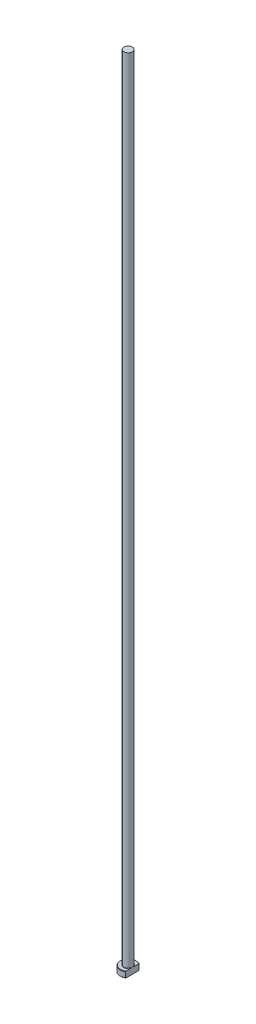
ISO-10303-21;
HEADER;
FILE_DESCRIPTION(('STEP AP214'),'2;1');
FILE_NAME('part.step','',(''),(''),'','','');
FILE_SCHEMA(('AUTOMOTIVE_DESIGN { 1 0 10303 214 1 1 1 1 }'));
ENDSEC;
DATA;
#1=APPLICATION_CONTEXT('core data for automotive mechanical design processes');
#2=APPLICATION_PROTOCOL_DEFINITION('international standard','automotive_design',2000,#1);
#3=PRODUCT_CONTEXT('',#1,'mechanical');
#4=PRODUCT('Part','Part','',(#3));
#5=PRODUCT_RELATED_PRODUCT_CATEGORY('part','',(#4));
#6=PRODUCT_DEFINITION_FORMATION('','',#4);
#7=PRODUCT_DEFINITION_CONTEXT('part definition',#1,'design');
#8=PRODUCT_DEFINITION('design','',#6,#7);
#9=PRODUCT_DEFINITION_SHAPE('','',#8);
#10=(LENGTH_UNIT() NAMED_UNIT(*) SI_UNIT(.MILLI.,.METRE.));
#11=(NAMED_UNIT(*) PLANE_ANGLE_UNIT() SI_UNIT($,.RADIAN.));
#12=(NAMED_UNIT(*) SI_UNIT($,.STERADIAN.) SOLID_ANGLE_UNIT());
#13=UNCERTAINTY_MEASURE_WITH_UNIT(LENGTH_MEASURE(1.E-05),#10,'distance_accuracy_value','');
#14=(GEOMETRIC_REPRESENTATION_CONTEXT(3) GLOBAL_UNCERTAINTY_ASSIGNED_CONTEXT((#13)) GLOBAL_UNIT_ASSIGNED_CONTEXT((#10,
#11,#12)) REPRESENTATION_CONTEXT('',''));
#15=CARTESIAN_POINT('',(0.,0.,0.));
#16=DIRECTION('',(0.,0.,1.));
#17=DIRECTION('',(1.,0.,0.));
#18=AXIS2_PLACEMENT_3D('',#15,#16,#17);
#19=CARTESIAN_POINT('',(0.,0.,0.));
#20=DIRECTION('',(0.,-1.,0.));
#21=DIRECTION('',(0.,0.,-1.));
#22=AXIS2_PLACEMENT_3D('',#19,#20,#21);
#23=PLANE('',#22);
#24=CARTESIAN_POINT('',(0.,0.,0.));
#25=DIRECTION('',(0.,-1.,0.));
#26=DIRECTION('',(0.,0.,-1.));
#27=AXIS2_PLACEMENT_3D('',#24,#25,#26);
#28=CIRCLE('',#27,3.80000000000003);
#29=CARTESIAN_POINT('',(2.09999999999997,0.,3.16701752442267));
#30=VERTEX_POINT('',#29);
#31=CARTESIAN_POINT('',(2.09999999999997,0.,-3.16701752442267));
#32=VERTEX_POINT('',#31);
#33=EDGE_CURVE('E98',#30,#32,#28,.T.);
#34=ORIENTED_EDGE('',*,*,#33,.T.);
#35=DIRECTION('',(0.,0.,1.));
#36=VECTOR('',#35,1.);
#37=CARTESIAN_POINT('',(2.09999999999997,0.,-3.40440890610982));
#38=LINE('',#37,#36);
#39=EDGE_CURVE('E83',#32,#30,#38,.T.);
#40=ORIENTED_EDGE('',*,*,#39,.T.);
#41=EDGE_LOOP('',(#34,#40));
#42=FACE_BOUND('',#41,.T.);
#43=ADVANCED_FACE('F32',(#42),#23,.T.);
#44=CARTESIAN_POINT('',(0.,259.958771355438,0.));
#45=DIRECTION('',(0.,1.,0.));
#46=DIRECTION('',(0.,0.,1.));
#47=AXIS2_PLACEMENT_3D('',#44,#45,#46);
#48=CYLINDRICAL_SURFACE('',#47,3.99999999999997);
#49=CARTESIAN_POINT('',(0.,2.80000000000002,0.));
#50=DIRECTION('',(0.,1.,0.));
#51=DIRECTION('',(0.,0.,1.));
#52=AXIS2_PLACEMENT_3D('',#49,#50,#51);
#53=CIRCLE('',#52,3.99999999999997);
#54=CARTESIAN_POINT('',(2.09999999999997,2.80000000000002,3.40440890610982));
#55=VERTEX_POINT('',#54);
#56=CARTESIAN_POINT('',(2.09999999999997,2.80000000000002,-3.40440890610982));
#57=VERTEX_POINT('',#56);
#58=EDGE_CURVE('E104',#55,#57,#53,.F.);
#59=ORIENTED_EDGE('',*,*,#58,.T.);
#60=DIRECTION('',(0.,-1.,0.));
#61=VECTOR('',#60,1.);
#62=CARTESIAN_POINT('',(2.09999999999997,400.,-3.40440890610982));
#63=LINE('',#62,#61);
#64=CARTESIAN_POINT('',(2.09999999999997,0.199999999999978,-3.40440890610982));
#65=VERTEX_POINT('',#64);
#66=EDGE_CURVE('E183',#57,#65,#63,.T.);
#67=ORIENTED_EDGE('',*,*,#66,.T.);
#68=CARTESIAN_POINT('',(0.,0.199999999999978,0.));
#69=DIRECTION('',(0.,-1.,0.));
#70=DIRECTION('',(0.,0.,-1.));
#71=AXIS2_PLACEMENT_3D('',#68,#69,#70);
#72=CIRCLE('',#71,3.99999999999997);
#73=CARTESIAN_POINT('',(2.09999999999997,0.199999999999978,3.40440890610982));
#74=VERTEX_POINT('',#73);
#75=EDGE_CURVE('E100',#65,#74,#72,.F.);
#76=ORIENTED_EDGE('',*,*,#75,.T.);
#77=DIRECTION('',(0.,-1.,0.));
#78=VECTOR('',#77,1.);
#79=CARTESIAN_POINT('',(2.09999999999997,400.,3.40440890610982));
#80=LINE('',#79,#78);
#81=EDGE_CURVE('E93',#55,#74,#80,.T.);
#82=ORIENTED_EDGE('',*,*,#81,.F.);
#83=EDGE_LOOP('',(#59,#67,#76,#82));
#84=FACE_BOUND('',#83,.T.);
#85=ADVANCED_FACE('F158',(#84),#48,.T.);
#86=CARTESIAN_POINT('',(-3.99999999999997,3.,0.));
#87=DIRECTION('',(0.,1.,0.));
#88=DIRECTION('',(0.,0.,1.));
#89=AXIS2_PLACEMENT_3D('',#86,#87,#88);
#90=PLANE('',#89);
#91=CARTESIAN_POINT('',(0.,3.,0.));
#92=DIRECTION('',(0.,1.,0.));
#93=DIRECTION('',(0.,0.,1.));
#94=AXIS2_PLACEMENT_3D('',#91,#92,#93);
#95=CIRCLE('',#94,3.80000000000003);
#96=CARTESIAN_POINT('',(2.09999999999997,3.,-3.16701752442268));
#97=VERTEX_POINT('',#96);
#98=CARTESIAN_POINT('',(2.09999999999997,3.,3.16701752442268));
#99=VERTEX_POINT('',#98);
#100=EDGE_CURVE('E178',#97,#99,#95,.T.);
#101=ORIENTED_EDGE('',*,*,#100,.T.);
#102=DIRECTION('',(0.,0.,-1.));
#103=VECTOR('',#102,1.);
#104=CARTESIAN_POINT('',(2.09999999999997,3.,0.));
#105=LINE('',#104,#103);
#106=CARTESIAN_POINT('',(2.09999999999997,2.99999999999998,0.938083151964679));
#107=VERTEX_POINT('',#106);
#108=EDGE_CURVE('E57',#99,#107,#105,.T.);
#109=ORIENTED_EDGE('',*,*,#108,.T.);
#110=CARTESIAN_POINT('',(0.,3.,0.));
#111=DIRECTION('',(0.,1.,0.));
#112=DIRECTION('',(0.,0.,1.));
#113=AXIS2_PLACEMENT_3D('',#110,#111,#112);
#114=CIRCLE('',#113,2.29999999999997);
#115=CARTESIAN_POINT('',(2.09999999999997,2.99999999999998,-0.938083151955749));
#116=VERTEX_POINT('',#115);
#117=EDGE_CURVE('E107',#107,#116,#114,.F.);
#118=ORIENTED_EDGE('',*,*,#117,.T.);
#119=EDGE_CURVE('E136',#116,#97,#105,.T.);
#120=ORIENTED_EDGE('',*,*,#119,.T.);
#121=EDGE_LOOP('',(#101,#109,#118,#120));
#122=FACE_BOUND('',#121,.T.);
#123=ADVANCED_FACE('F147',(#122),#90,.T.);
#124=CARTESIAN_POINT('',(0.,3.,0.));
#125=DIRECTION('',(0.,-1.,0.));
#126=DIRECTION('',(0.,0.,-1.));
#127=AXIS2_PLACEMENT_3D('',#124,#125,#126);
#128=CONICAL_SURFACE('',#127,3.80000000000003,0.785398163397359);
#129=ORIENTED_EDGE('',*,*,#58,.F.);
#130=CARTESIAN_POINT('',(2.09999999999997,-0.980423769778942,7.49166163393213));
#131=CARTESIAN_POINT('',(2.09999999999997,-0.83147426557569,7.33696373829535));
#132=CARTESIAN_POINT('',(2.09999999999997,-0.682692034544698,7.18210431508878));
#133=CARTESIAN_POINT('',(2.09999999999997,-0.385548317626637,6.8719796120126));
#134=CARTESIAN_POINT('',(2.09999999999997,-0.237186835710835,6.71671432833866));
#135=CARTESIAN_POINT('',(2.09999999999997,0.0590779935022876,6.40564381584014));
#136=CARTESIAN_POINT('',(2.09999999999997,0.206981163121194,6.24983841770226));
#137=CARTESIAN_POINT('',(2.09999999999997,0.502154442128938,5.9376299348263));
#138=CARTESIAN_POINT('',(2.09999999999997,0.649424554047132,5.78122685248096));
#139=CARTESIAN_POINT('',(2.09999999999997,0.94077633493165,5.47022973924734));
#140=CARTESIAN_POINT('',(2.09999999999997,1.08487085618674,5.31564775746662));
#141=CARTESIAN_POINT('',(2.09999999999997,1.372076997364,5.00557364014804));
#142=CARTESIAN_POINT('',(2.09999999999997,1.51518862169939,4.85008150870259));
#143=CARTESIAN_POINT('',(2.09999999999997,1.80010839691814,4.53794892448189));
#144=CARTESIAN_POINT('',(2.09999999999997,1.9419167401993,4.38130864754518));
#145=CARTESIAN_POINT('',(2.09999999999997,2.22381768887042,4.06649383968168));
#146=CARTESIAN_POINT('',(2.09999999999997,2.36391033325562,3.90831934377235));
#147=CARTESIAN_POINT('',(2.09999999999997,2.60581733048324,3.63104485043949));
#148=CARTESIAN_POINT('',(2.09999999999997,2.70816653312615,3.51241214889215));
#149=CARTESIAN_POINT('',(2.09999999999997,2.9111669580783,3.27367935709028));
#150=CARTESIAN_POINT('',(2.09999999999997,3.01181801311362,3.15357912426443));
#151=CARTESIAN_POINT('',(2.09999999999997,3.21179811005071,2.9103337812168));
#152=CARTESIAN_POINT('',(2.09999999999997,3.31110514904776,2.78717050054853));
#153=CARTESIAN_POINT('',(2.09999999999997,3.50648239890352,2.53834531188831));
#154=CARTESIAN_POINT('',(2.09999999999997,3.60255343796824,2.41268405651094));
#155=CARTESIAN_POINT('',(2.09999999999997,3.79142541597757,2.15619995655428));
#156=CARTESIAN_POINT('',(2.09999999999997,3.88416307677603,2.0253298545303));
#157=CARTESIAN_POINT('',(2.09999999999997,4.01801013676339,1.82534891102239));
#158=CARTESIAN_POINT('',(2.09999999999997,4.06178099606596,1.75802258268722));
#159=CARTESIAN_POINT('',(2.09999999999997,4.14708263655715,1.62197021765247));
#160=CARTESIAN_POINT('',(2.09999999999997,4.18861364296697,1.55324432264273));
#161=CARTESIAN_POINT('',(2.09999999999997,4.26843053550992,1.41491925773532));
#162=CARTESIAN_POINT('',(2.09999999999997,4.30674712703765,1.34533804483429));
#163=CARTESIAN_POINT('',(2.09999999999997,4.3798981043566,1.20437862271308));
#164=CARTESIAN_POINT('',(2.09999999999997,4.41473181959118,1.13300007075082));
#165=CARTESIAN_POINT('',(2.09999999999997,4.51246602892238,0.916193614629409));
#166=CARTESIAN_POINT('',(2.09999999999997,4.56890635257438,0.767589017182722));
#167=CARTESIAN_POINT('',(2.09999999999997,4.63146309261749,0.545044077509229));
#168=CARTESIAN_POINT('',(2.09999999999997,4.64829911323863,0.474096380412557));
#169=CARTESIAN_POINT('',(2.09999999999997,4.67524959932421,0.330910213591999));
#170=CARTESIAN_POINT('',(2.09999999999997,4.685364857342,0.258671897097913));
#171=CARTESIAN_POINT('',(2.09999999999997,4.69814808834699,0.113837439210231));
#172=CARTESIAN_POINT('',(2.09999999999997,4.70084750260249,0.0412441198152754));
#173=CARTESIAN_POINT('',(2.09999999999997,4.69868618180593,-0.103832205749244));
#174=CARTESIAN_POINT('',(2.09999999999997,4.69382503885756,-0.176315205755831));
#175=CARTESIAN_POINT('',(2.09999999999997,4.67696192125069,-0.319913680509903));
#176=CARTESIAN_POINT('',(2.09999999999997,4.66501009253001,-0.391035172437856));
#177=CARTESIAN_POINT('',(2.09999999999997,4.63477414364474,-0.531925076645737));
#178=CARTESIAN_POINT('',(2.09999999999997,4.61648741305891,-0.601692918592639));
#179=CARTESIAN_POINT('',(2.09999999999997,4.57440952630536,-0.740018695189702));
#180=CARTESIAN_POINT('',(2.09999999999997,4.5505834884,-0.808565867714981));
#181=CARTESIAN_POINT('',(2.09999999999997,4.49846635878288,-0.94390305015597));
#182=CARTESIAN_POINT('',(2.09999999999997,4.47017609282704,-1.01069338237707));
#183=CARTESIAN_POINT('',(2.09999999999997,4.38350646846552,-1.20069593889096));
#184=CARTESIAN_POINT('',(2.09999999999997,4.32056256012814,-1.32181878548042));
#185=CARTESIAN_POINT('',(2.09999999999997,4.1862118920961,-1.55931752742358));
#186=CARTESIAN_POINT('',(2.09999999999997,4.1147953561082,-1.67568772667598));
#187=CARTESIAN_POINT('',(2.09999999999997,3.96595132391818,-1.90511626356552));
#188=CARTESIAN_POINT('',(2.09999999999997,3.88850194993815,-2.01816028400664));
#189=CARTESIAN_POINT('',(2.09999999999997,3.72960863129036,-2.24129989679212));
#190=CARTESIAN_POINT('',(2.09999999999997,3.64816653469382,-2.3513968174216));
#191=CARTESIAN_POINT('',(2.09999999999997,3.48133411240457,-2.57073305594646));
#192=CARTESIAN_POINT('',(2.09999999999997,3.39590709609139,-2.67994433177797));
#193=CARTESIAN_POINT('',(2.09999999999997,3.2228375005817,-2.89660720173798));
#194=CARTESIAN_POINT('',(2.09999999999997,3.1351947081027,-3.00405862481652));
#195=CARTESIAN_POINT('',(2.09999999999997,2.95843815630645,-3.21731964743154));
#196=CARTESIAN_POINT('',(2.09999999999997,2.86932829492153,-3.32313248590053));
#197=CARTESIAN_POINT('',(2.09999999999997,2.68980874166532,-3.53365081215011));
#198=CARTESIAN_POINT('',(2.09999999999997,2.59939902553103,-3.6383562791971));
#199=CARTESIAN_POINT('',(2.09999999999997,2.36547490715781,-3.90659393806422));
#200=CARTESIAN_POINT('',(2.09999999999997,2.2212060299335,-4.06946765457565));
#201=CARTESIAN_POINT('',(2.09999999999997,1.93085962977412,-4.39359699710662));
#202=CARTESIAN_POINT('',(2.09999999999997,1.78478206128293,-4.55485258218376));
#203=CARTESIAN_POINT('',(2.09999999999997,1.49115582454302,-4.87627982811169));
#204=CARTESIAN_POINT('',(2.09999999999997,1.3436059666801,-5.03645040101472));
#205=CARTESIAN_POINT('',(2.09999999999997,1.04748117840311,-5.35584132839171));
#206=CARTESIAN_POINT('',(2.09999999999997,0.898906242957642,-5.51506167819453));
#207=CARTESIAN_POINT('',(2.09999999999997,0.463656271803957,-5.9791777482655));
#208=CARTESIAN_POINT('',(2.09999999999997,0.175917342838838,-6.28307552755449));
#209=CARTESIAN_POINT('',(2.09999999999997,-0.256953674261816,-6.73740739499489));
#210=CARTESIAN_POINT('',(2.09999999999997,-0.40137728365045,-6.888518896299));
#211=CARTESIAN_POINT('',(2.09999999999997,-0.690621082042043,-7.1903594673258));
#212=CARTESIAN_POINT('',(2.09999999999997,-0.835441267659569,-7.34108854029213));
#213=CARTESIAN_POINT('',(2.09999999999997,-0.980423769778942,-7.49166163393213));
#214=B_SPLINE_CURVE_WITH_KNOTS('',3,(#130,#131,#132,#133,#134,#135,#136,#137,#138,#139,#140,
#141,#142,#143,#144,#145,#146,#147,#148,#149,#150,#151,#152,#153,#154,#155,#156,#157,#158,#159,
#160,#161,#162,#163,#164,#165,#166,#167,#168,#169,#170,#171,#172,#173,#174,#175,#176,#177,#178,
#179,#180,#181,#182,#183,#184,#185,#186,#187,#188,#189,#190,#191,#192,#193,#194,#195,#196,#197,
#198,#199,#200,#201,#202,#203,#204,#205,#206,#207,#208,#209,#210,#211,#212,#213),.UNSPECIFIED.,
.F.,.F.,(4,2,2,2,2,2,2,2,2,2,2,2,2,2,2,2,2,2,2,2,2,2,2,2,2,2,2,2,2,2,2,2,2,2,2,2,2,2,2,2,2,4),
(0.,0.644249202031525,1.28850446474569,1.93298425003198,2.57746145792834,3.21143723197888,
3.84541015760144,4.47928793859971,5.1131512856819,5.58318355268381,6.05326185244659,
6.52785804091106,7.00233182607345,7.48334172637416,7.72421875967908,7.96507152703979,
8.20327136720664,8.44151697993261,8.91624038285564,9.13473354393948,9.35320093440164,
9.57074063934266,9.78829208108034,10.0043230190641,10.2204430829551,10.4379628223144,
10.6554423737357,11.0643686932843,11.4737715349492,11.8847351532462,12.2955103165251,
12.7114337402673,13.1273973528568,13.5423929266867,13.9573962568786,14.6101174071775,
15.2628550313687,15.9161714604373,16.5694910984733,17.8249945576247,18.4520794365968,
19.0791589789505),.UNSPECIFIED.);
#215=EDGE_CURVE('E135',#55,#99,#214,.T.);
#216=ORIENTED_EDGE('',*,*,#215,.T.);
#217=ORIENTED_EDGE('',*,*,#100,.F.);
#218=EDGE_CURVE('E127',#97,#57,#214,.T.);
#219=ORIENTED_EDGE('',*,*,#218,.T.);
#220=EDGE_LOOP('',(#129,#216,#217,#219));
#221=FACE_BOUND('',#220,.T.);
#222=ADVANCED_FACE('F143',(#221),#128,.T.);
#223=CARTESIAN_POINT('',(0.,0.199999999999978,0.));
#224=DIRECTION('',(0.,1.,0.));
#225=DIRECTION('',(0.,0.,1.));
#226=AXIS2_PLACEMENT_3D('',#223,#224,#225);
#227=CONICAL_SURFACE('',#226,3.99999999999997,0.785398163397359);
#228=ORIENTED_EDGE('',*,*,#75,.F.);
#229=CARTESIAN_POINT('',(2.09999999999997,3.98042376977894,-7.49166163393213));
#230=CARTESIAN_POINT('',(2.09999999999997,3.83147426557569,-7.33696373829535));
#231=CARTESIAN_POINT('',(2.09999999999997,3.6826920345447,-7.18210431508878));
#232=CARTESIAN_POINT('',(2.09999999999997,3.38554831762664,-6.8719796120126));
#233=CARTESIAN_POINT('',(2.09999999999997,3.23718683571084,-6.71671432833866));
#234=CARTESIAN_POINT('',(2.09999999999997,2.94092200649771,-6.40564381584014));
#235=CARTESIAN_POINT('',(2.09999999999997,2.79301883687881,-6.24983841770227));
#236=CARTESIAN_POINT('',(2.09999999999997,2.49784555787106,-5.9376299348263));
#237=CARTESIAN_POINT('',(2.09999999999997,2.35057544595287,-5.78122685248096));
#238=CARTESIAN_POINT('',(2.09999999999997,2.05922366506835,-5.47022973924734));
#239=CARTESIAN_POINT('',(2.09999999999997,1.91512914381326,-5.31564775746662));
#240=CARTESIAN_POINT('',(2.09999999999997,1.62792300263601,-5.00557364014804));
#241=CARTESIAN_POINT('',(2.09999999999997,1.48481137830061,-4.85008150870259));
#242=CARTESIAN_POINT('',(2.09999999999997,1.19989160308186,-4.53794892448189));
#243=CARTESIAN_POINT('',(2.09999999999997,1.05808325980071,-4.38130864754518));
#244=CARTESIAN_POINT('',(2.09999999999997,0.776182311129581,-4.06649383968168));
#245=CARTESIAN_POINT('',(2.09999999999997,0.636089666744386,-3.90831934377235));
#246=CARTESIAN_POINT('',(2.09999999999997,0.394182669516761,-3.63104485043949));
#247=CARTESIAN_POINT('',(2.09999999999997,0.291833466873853,-3.51241214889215));
#248=CARTESIAN_POINT('',(2.09999999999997,0.0888330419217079,-3.27367935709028));
#249=CARTESIAN_POINT('',(2.09999999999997,-0.011818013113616,-3.15357912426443));
#250=CARTESIAN_POINT('',(2.09999999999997,-0.211798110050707,-2.9103337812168));
#251=CARTESIAN_POINT('',(2.09999999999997,-0.311105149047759,-2.78717050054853));
#252=CARTESIAN_POINT('',(2.09999999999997,-0.506482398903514,-2.53834531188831));
#253=CARTESIAN_POINT('',(2.09999999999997,-0.602553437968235,-2.41268405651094));
#254=CARTESIAN_POINT('',(2.09999999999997,-0.791425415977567,-2.15619995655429));
#255=CARTESIAN_POINT('',(2.09999999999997,-0.884163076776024,-2.0253298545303));
#256=CARTESIAN_POINT('',(2.09999999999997,-1.01801013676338,-1.82534891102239));
#257=CARTESIAN_POINT('',(2.09999999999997,-1.06178099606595,-1.75802258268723));
#258=CARTESIAN_POINT('',(2.09999999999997,-1.14708263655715,-1.62197021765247));
#259=CARTESIAN_POINT('',(2.09999999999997,-1.18861364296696,-1.55324432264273));
#260=CARTESIAN_POINT('',(2.09999999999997,-1.26843053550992,-1.41491925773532));
#261=CARTESIAN_POINT('',(2.09999999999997,-1.30674712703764,-1.34533804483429));
#262=CARTESIAN_POINT('',(2.09999999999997,-1.3798981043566,-1.20437862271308));
#263=CARTESIAN_POINT('',(2.09999999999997,-1.41473181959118,-1.13300007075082));
#264=CARTESIAN_POINT('',(2.09999999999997,-1.51246602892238,-0.916193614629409));
#265=CARTESIAN_POINT('',(2.09999999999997,-1.56890635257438,-0.767589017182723));
#266=CARTESIAN_POINT('',(2.09999999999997,-1.63146309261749,-0.54504407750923));
#267=CARTESIAN_POINT('',(2.09999999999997,-1.64829911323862,-0.474096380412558));
#268=CARTESIAN_POINT('',(2.09999999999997,-1.67524959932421,-0.330910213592));
#269=CARTESIAN_POINT('',(2.09999999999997,-1.68536485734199,-0.258671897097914));
#270=CARTESIAN_POINT('',(2.09999999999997,-1.69814808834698,-0.113837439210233));
#271=CARTESIAN_POINT('',(2.09999999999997,-1.70084750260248,-0.0412441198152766));
#272=CARTESIAN_POINT('',(2.09999999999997,-1.69868618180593,0.103832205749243));
#273=CARTESIAN_POINT('',(2.09999999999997,-1.69382503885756,0.17631520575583));
#274=CARTESIAN_POINT('',(2.09999999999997,-1.67696192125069,0.319913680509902));
#275=CARTESIAN_POINT('',(2.09999999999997,-1.66501009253,0.391035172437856));
#276=CARTESIAN_POINT('',(2.09999999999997,-1.63477414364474,0.531925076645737));
#277=CARTESIAN_POINT('',(2.09999999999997,-1.61648741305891,0.60169291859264));
#278=CARTESIAN_POINT('',(2.09999999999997,-1.57440952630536,0.740018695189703));
#279=CARTESIAN_POINT('',(2.09999999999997,-1.5505834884,0.808565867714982));
#280=CARTESIAN_POINT('',(2.09999999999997,-1.49846635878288,0.943903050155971));
#281=CARTESIAN_POINT('',(2.09999999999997,-1.47017609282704,1.01069338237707));
#282=CARTESIAN_POINT('',(2.09999999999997,-1.38350646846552,1.20069593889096));
#283=CARTESIAN_POINT('',(2.09999999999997,-1.32056256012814,1.32181878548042));
#284=CARTESIAN_POINT('',(2.09999999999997,-1.1862118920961,1.55931752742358));
#285=CARTESIAN_POINT('',(2.09999999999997,-1.11479535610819,1.67568772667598));
#286=CARTESIAN_POINT('',(2.09999999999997,-0.965951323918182,1.90511626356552));
#287=CARTESIAN_POINT('',(2.09999999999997,-0.888501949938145,2.01816028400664));
#288=CARTESIAN_POINT('',(2.09999999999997,-0.729608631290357,2.24129989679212));
#289=CARTESIAN_POINT('',(2.09999999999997,-0.648166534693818,2.3513968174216));
#290=CARTESIAN_POINT('',(2.09999999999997,-0.481334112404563,2.57073305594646));
#291=CARTESIAN_POINT('',(2.09999999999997,-0.395907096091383,2.67994433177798));
#292=CARTESIAN_POINT('',(2.09999999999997,-0.222837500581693,2.89660720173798));
#293=CARTESIAN_POINT('',(2.09999999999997,-0.135194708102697,3.00405862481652));
#294=CARTESIAN_POINT('',(2.09999999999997,0.041561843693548,3.21731964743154));
#295=CARTESIAN_POINT('',(2.09999999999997,0.130671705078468,3.32313248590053));
#296=CARTESIAN_POINT('',(2.09999999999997,0.310191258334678,3.53365081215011));
#297=CARTESIAN_POINT('',(2.09999999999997,0.400600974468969,3.6383562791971));
#298=CARTESIAN_POINT('',(2.09999999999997,0.634525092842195,3.90659393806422));
#299=CARTESIAN_POINT('',(2.09999999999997,0.778793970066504,4.06946765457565));
#300=CARTESIAN_POINT('',(2.09999999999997,1.06914037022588,4.39359699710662));
#301=CARTESIAN_POINT('',(2.09999999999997,1.21521793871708,4.55485258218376));
#302=CARTESIAN_POINT('',(2.09999999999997,1.50884417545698,4.87627982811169));
#303=CARTESIAN_POINT('',(2.09999999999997,1.65639403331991,5.03645040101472));
#304=CARTESIAN_POINT('',(2.09999999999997,1.9525188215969,5.35584132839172));
#305=CARTESIAN_POINT('',(2.09999999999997,2.10109375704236,5.51506167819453));
#306=CARTESIAN_POINT('',(2.09999999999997,2.53634372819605,5.9791777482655));
#307=CARTESIAN_POINT('',(2.09999999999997,2.82408265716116,6.28307552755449));
#308=CARTESIAN_POINT('',(2.09999999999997,3.25695367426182,6.73740739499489));
#309=CARTESIAN_POINT('',(2.09999999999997,3.40137728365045,6.88851889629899));
#310=CARTESIAN_POINT('',(2.09999999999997,3.69062108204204,7.1903594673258));
#311=CARTESIAN_POINT('',(2.09999999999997,3.83544126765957,7.34108854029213));
#312=CARTESIAN_POINT('',(2.09999999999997,3.98042376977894,7.49166163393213));
#313=B_SPLINE_CURVE_WITH_KNOTS('',3,(#229,#230,#231,#232,#233,#234,#235,#236,#237,#238,#239,
#240,#241,#242,#243,#244,#245,#246,#247,#248,#249,#250,#251,#252,#253,#254,#255,#256,#257,#258,
#259,#260,#261,#262,#263,#264,#265,#266,#267,#268,#269,#270,#271,#272,#273,#274,#275,#276,#277,
#278,#279,#280,#281,#282,#283,#284,#285,#286,#287,#288,#289,#290,#291,#292,#293,#294,#295,#296,
#297,#298,#299,#300,#301,#302,#303,#304,#305,#306,#307,#308,#309,#310,#311,#312),.UNSPECIFIED.,
.F.,.F.,(4,2,2,2,2,2,2,2,2,2,2,2,2,2,2,2,2,2,2,2,2,2,2,2,2,2,2,2,2,2,2,2,2,2,2,2,2,2,2,2,2,4),
(0.,0.644249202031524,1.28850446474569,1.93298425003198,2.57746145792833,3.21143723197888,
3.84541015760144,4.47928793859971,5.1131512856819,5.58318355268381,6.05326185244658,
6.52785804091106,7.00233182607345,7.48334172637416,7.72421875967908,7.96507152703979,
8.20327136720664,8.44151697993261,8.91624038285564,9.13473354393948,9.35320093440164,
9.57074063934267,9.78829208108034,10.0043230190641,10.2204430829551,10.4379628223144,
10.6554423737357,11.0643686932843,11.4737715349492,11.8847351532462,12.2955103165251,
12.7114337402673,13.1273973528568,13.5423929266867,13.9573962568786,14.6101174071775,
15.2628550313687,15.9161714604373,16.5694910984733,17.8249945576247,18.4520794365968,
19.0791589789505),.UNSPECIFIED.);
#314=EDGE_CURVE('E86',#65,#32,#313,.T.);
#315=ORIENTED_EDGE('',*,*,#314,.T.);
#316=ORIENTED_EDGE('',*,*,#33,.F.);
#317=EDGE_CURVE('E89',#30,#74,#313,.T.);
#318=ORIENTED_EDGE('',*,*,#317,.T.);
#319=EDGE_LOOP('',(#228,#315,#316,#318));
#320=FACE_BOUND('',#319,.T.);
#321=ADVANCED_FACE('F97',(#320),#227,.T.);
#322=CARTESIAN_POINT('',(0.,3.19999999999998,0.));
#323=DIRECTION('',(0.,1.,0.));
#324=DIRECTION('',(0.,0.,1.));
#325=AXIS2_PLACEMENT_3D('',#322,#323,#324);
#326=TOROIDAL_SURFACE('',#325,2.29999999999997,0.2);
#327=CARTESIAN_POINT('',(2.09999999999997,3.19999999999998,0.));
#328=CARTESIAN_POINT('',(2.09999999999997,3.20000050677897,1.12871213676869E-10));
#329=CARTESIAN_POINT('',(2.09999999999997,3.20000101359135,-1.5160230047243E-07));
#330=CARTESIAN_POINT('',(2.09999999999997,3.20000197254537,-5.98005719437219E-07));
#331=CARTESIAN_POINT('',(2.09999999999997,3.2000024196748,-9.0062574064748E-07));
#332=CARTESIAN_POINT('',(2.09999999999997,3.20000332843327,-1.62318945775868E-06));
#333=CARTESIAN_POINT('',(2.09999999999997,3.20000378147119,-2.05406588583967E-06));
#334=CARTESIAN_POINT('',(2.09999999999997,3.20000461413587,-2.96308561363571E-06));
#335=CARTESIAN_POINT('',(2.09999999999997,3.20000499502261,-3.4401425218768E-06));
#336=CARTESIAN_POINT('',(2.09999999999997,3.20000634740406,-5.22586037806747E-06));
#337=CARTESIAN_POINT('',(2.09999999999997,3.20000724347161,-6.59340897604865E-06));
#338=CARTESIAN_POINT('',(2.09999999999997,3.20000877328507,-9.35203600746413E-06));
#339=CARTESIAN_POINT('',(2.09999999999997,3.20000941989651,-1.07363396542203E-05));
#340=CARTESIAN_POINT('',(2.09999999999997,3.20001201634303,-1.6407290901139E-05));
#341=CARTESIAN_POINT('',(2.09999999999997,3.20001387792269,-2.07387533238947E-05));
#342=CARTESIAN_POINT('',(2.09999999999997,3.2000167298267,-2.90585196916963E-05));
#343=CARTESIAN_POINT('',(2.09999999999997,3.20001780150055,-3.30191375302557E-05));
#344=CARTESIAN_POINT('',(2.09999999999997,3.20002541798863,-6.18759983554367E-05));
#345=CARTESIAN_POINT('',(2.09999999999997,3.20003100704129,-8.69774695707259E-05));
#346=CARTESIAN_POINT('',(2.09999999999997,3.20005545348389,-0.000185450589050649));
#347=CARTESIAN_POINT('',(2.09999999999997,3.20007895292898,-0.000257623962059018));
#348=CARTESIAN_POINT('',(2.09999999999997,3.20016974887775,-0.000541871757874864));
#349=CARTESIAN_POINT('',(2.09999999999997,3.20023388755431,-0.000754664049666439));
#350=CARTESIAN_POINT('',(2.09999999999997,3.20048929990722,-0.00159500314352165));
#351=CARTESIAN_POINT('',(2.09999999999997,3.2006844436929,-0.00222165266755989));
#352=CARTESIAN_POINT('',(2.09999999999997,3.2014903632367,-0.00481735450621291));
#353=CARTESIAN_POINT('',(2.09999999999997,3.2020963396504,-0.0067875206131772));
#354=CARTESIAN_POINT('',(2.09999999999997,3.20811857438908,-0.0263575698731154));
#355=CARTESIAN_POINT('',(2.09999999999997,3.21355673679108,-0.0439525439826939));
#356=CARTESIAN_POINT('',(2.09999999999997,3.22417769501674,-0.078471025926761));
#357=CARTESIAN_POINT('',(2.09999999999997,3.22936219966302,-0.0953940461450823));
#358=CARTESIAN_POINT('',(2.09999999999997,3.24031741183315,-0.131344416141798));
#359=CARTESIAN_POINT('',(2.09999999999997,3.24608153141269,-0.150373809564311));
#360=CARTESIAN_POINT('',(2.09999999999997,3.25756719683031,-0.188666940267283));
#361=CARTESIAN_POINT('',(2.09999999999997,3.263287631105,-0.207931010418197));
#362=CARTESIAN_POINT('',(2.09999999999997,3.27708776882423,-0.255037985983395));
#363=CARTESIAN_POINT('',(2.09999999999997,3.2850908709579,-0.282903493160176));
#364=CARTESIAN_POINT('',(2.09999999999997,3.30049018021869,-0.33805925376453));
#365=CARTESIAN_POINT('',(2.09999999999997,3.30789650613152,-0.365346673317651));
#366=CARTESIAN_POINT('',(2.09999999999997,3.32422959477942,-0.427831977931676));
#367=CARTESIAN_POINT('',(2.09999999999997,3.33299018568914,-0.46307381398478));
#368=CARTESIAN_POINT('',(2.09999999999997,3.34944378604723,-0.534083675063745));
#369=CARTESIAN_POINT('',(2.09999999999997,3.35712842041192,-0.569853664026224));
#370=CARTESIAN_POINT('',(2.09999999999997,3.37150595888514,-0.644262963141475));
#371=CARTESIAN_POINT('',(2.09999999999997,3.37808822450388,-0.682924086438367));
#372=CARTESIAN_POINT('',(2.09999999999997,3.38900927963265,-0.760558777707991));
#373=CARTESIAN_POINT('',(2.09999999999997,3.39334901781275,-0.799532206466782));
#374=CARTESIAN_POINT('',(2.09999999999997,3.39885385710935,-0.874699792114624));
#375=CARTESIAN_POINT('',(2.09999999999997,3.40023755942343,-0.910877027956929));
#376=CARTESIAN_POINT('',(2.09999999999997,3.39969515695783,-0.983205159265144));
#377=CARTESIAN_POINT('',(2.09999999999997,3.39777304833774,-1.01935603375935));
#378=CARTESIAN_POINT('',(2.09999999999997,3.39020522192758,-1.08431292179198));
#379=CARTESIAN_POINT('',(2.09999999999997,3.38533825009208,-1.11320671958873));
#380=CARTESIAN_POINT('',(2.09999999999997,3.37160685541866,-1.1700898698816));
#381=CARTESIAN_POINT('',(2.09999999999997,3.36275087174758,-1.19808099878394));
#382=CARTESIAN_POINT('',(2.09999999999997,3.34648318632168,-1.23525714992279));
#383=CARTESIAN_POINT('',(2.09999999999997,3.34148711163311,-1.24549622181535));
#384=CARTESIAN_POINT('',(2.09999999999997,3.33045865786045,-1.26542566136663));
#385=CARTESIAN_POINT('',(2.09999999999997,3.32442526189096,-1.27511547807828));
#386=CARTESIAN_POINT('',(2.09999999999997,3.31108244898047,-1.29375285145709));
#387=CARTESIAN_POINT('',(2.09999999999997,3.30375956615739,-1.30269093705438));
#388=CARTESIAN_POINT('',(2.09999999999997,3.28770931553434,-1.31920846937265));
#389=CARTESIAN_POINT('',(2.09999999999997,3.27898657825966,-1.32679222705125));
#390=CARTESIAN_POINT('',(2.09999999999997,3.26379332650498,-1.33730272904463));
#391=CARTESIAN_POINT('',(2.09999999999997,3.25778099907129,-1.34088947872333));
#392=CARTESIAN_POINT('',(2.09999999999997,3.24526530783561,-1.34707853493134));
#393=CARTESIAN_POINT('',(2.09999999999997,3.23876236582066,-1.34968167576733));
#394=CARTESIAN_POINT('',(2.09999999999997,3.22533138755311,-1.35371298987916));
#395=CARTESIAN_POINT('',(2.09999999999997,3.21840009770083,-1.35513055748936));
#396=CARTESIAN_POINT('',(2.09999999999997,3.2043942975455,-1.35660326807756));
#397=CARTESIAN_POINT('',(2.09999999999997,3.19731988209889,-1.35665928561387));
#398=CARTESIAN_POINT('',(2.09999999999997,3.18410044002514,-1.35547833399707));
#399=CARTESIAN_POINT('',(2.09999999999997,3.17794157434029,-1.3543883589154));
#400=CARTESIAN_POINT('',(2.09999999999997,3.16588195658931,-1.35123020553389));
#401=CARTESIAN_POINT('',(2.09999999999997,3.15998132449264,-1.34916157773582));
#402=CARTESIAN_POINT('',(2.09999999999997,3.14673410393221,-1.34339681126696));
#403=CARTESIAN_POINT('',(2.09999999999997,3.13952216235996,-1.33939261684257));
#404=CARTESIAN_POINT('',(2.09999999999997,3.1258371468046,-1.33027651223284));
#405=CARTESIAN_POINT('',(2.09999999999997,3.11936569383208,-1.3251622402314));
#406=CARTESIAN_POINT('',(2.09999999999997,3.10400061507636,-1.31126465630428));
#407=CARTESIAN_POINT('',(2.09999999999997,3.09558831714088,-1.3019528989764));
#408=CARTESIAN_POINT('',(2.09999999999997,3.0802757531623,-1.28218529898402));
#409=CARTESIAN_POINT('',(2.09999999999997,3.07337755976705,-1.27172791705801));
#410=CARTESIAN_POINT('',(2.09999999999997,3.05595453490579,-1.24164701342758));
#411=CARTESIAN_POINT('',(2.09999999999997,3.0467992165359,-1.22123760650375));
#412=CARTESIAN_POINT('',(2.09999999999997,3.03140603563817,-1.17923303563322));
#413=CARTESIAN_POINT('',(2.09999999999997,3.02519350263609,-1.15762930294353));
#414=CARTESIAN_POINT('',(2.09999999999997,3.014897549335,-1.11311363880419));
#415=CARTESIAN_POINT('',(2.09999999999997,3.01089884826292,-1.09018261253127));
#416=CARTESIAN_POINT('',(2.09999999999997,3.00485282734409,-1.04403569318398));
#417=CARTESIAN_POINT('',(2.09999999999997,3.00280937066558,-1.02081932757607));
#418=CARTESIAN_POINT('',(2.09999999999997,2.99913236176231,-0.952629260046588));
#419=CARTESIAN_POINT('',(2.09999999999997,2.99965574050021,-0.907543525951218));
#420=CARTESIAN_POINT('',(2.09999999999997,3.00580977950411,-0.79983290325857));
#421=CARTESIAN_POINT('',(2.09999999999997,3.01338406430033,-0.737345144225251));
#422=CARTESIAN_POINT('',(2.09999999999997,3.03389167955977,-0.611758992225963));
#423=CARTESIAN_POINT('',(2.09999999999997,3.04695134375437,-0.548682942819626));
#424=CARTESIAN_POINT('',(2.09999999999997,3.07174522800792,-0.44346393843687));
#425=CARTESIAN_POINT('',(2.09999999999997,3.08256100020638,-0.401095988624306));
#426=CARTESIAN_POINT('',(2.09999999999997,3.10517491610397,-0.317118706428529));
#427=CARTESIAN_POINT('',(2.09999999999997,3.11696109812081,-0.275506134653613));
#428=CARTESIAN_POINT('',(2.09999999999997,3.13984946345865,-0.197106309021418));
#429=CARTESIAN_POINT('',(2.09999999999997,3.15088145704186,-0.160298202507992));
#430=CARTESIAN_POINT('',(2.09999999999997,3.17371469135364,-0.0852465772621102));
#431=CARTESIAN_POINT('',(2.09999999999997,3.18552885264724,-0.0470069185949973));
#432=CARTESIAN_POINT('',(2.09999999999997,3.1979046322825,-0.00678406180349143));
#433=CARTESIAN_POINT('',(2.09999999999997,3.19851173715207,-0.0048104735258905));
#434=CARTESIAN_POINT('',(2.09999999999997,3.19931792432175,-0.00221397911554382));
#435=CARTESIAN_POINT('',(2.09999999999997,3.19951224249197,-0.00158996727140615));
#436=CARTESIAN_POINT('',(2.09999999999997,3.19976664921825,-0.000752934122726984));
#437=CARTESIAN_POINT('',(2.09999999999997,3.1998305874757,-0.000540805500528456));
#438=CARTESIAN_POINT('',(2.09999999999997,3.19992113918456,-0.00025733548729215));
#439=CARTESIAN_POINT('',(2.09999999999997,3.19994460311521,-0.000185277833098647));
#440=CARTESIAN_POINT('',(2.09999999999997,3.19996901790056,-8.69395480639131E-05));
#441=CARTESIAN_POINT('',(2.09999999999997,3.1999746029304,-6.18551879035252E-05));
#442=CARTESIAN_POINT('',(2.09999999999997,3.19998221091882,-3.30155874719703E-05));
#443=CARTESIAN_POINT('',(2.09999999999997,3.19998328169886,-2.90560037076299E-05));
#444=CARTESIAN_POINT('',(2.09999999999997,3.19998613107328,-2.07382812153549E-05));
#445=CARTESIAN_POINT('',(2.09999999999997,3.19998799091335,-1.64077754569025E-05));
#446=CARTESIAN_POINT('',(2.09999999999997,3.19999058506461,-1.0737787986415E-05));
#447=CARTESIAN_POINT('',(2.09999999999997,3.19999123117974,-9.35356155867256E-06));
#448=CARTESIAN_POINT('',(2.09999999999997,3.19999275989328,-6.59500016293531E-06));
#449=CARTESIAN_POINT('',(2.09999999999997,3.19999365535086,-5.22743189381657E-06));
#450=CARTESIAN_POINT('',(2.09999999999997,3.19999500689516,-3.44158185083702E-06));
#451=CARTESIAN_POINT('',(2.09999999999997,3.19999538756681,-2.96446374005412E-06));
#452=CARTESIAN_POINT('',(2.09999999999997,3.19999621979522,-2.05528284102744E-06));
#453=CARTESIAN_POINT('',(2.09999999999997,3.1999966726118,-1.62430552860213E-06));
#454=CARTESIAN_POINT('',(2.09999999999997,3.19999758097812,-9.01501322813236E-07));
#455=CARTESIAN_POINT('',(2.09999999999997,3.19999802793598,-5.98749119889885E-07));
#456=CARTESIAN_POINT('',(2.09999999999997,3.19999898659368,-1.52018312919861E-07));
#457=CARTESIAN_POINT('',(2.09999999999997,3.19999949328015,-1.12858037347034E-10));
#458=CARTESIAN_POINT('',(2.09999999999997,3.19999999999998,0.));
#459=B_SPLINE_CURVE_WITH_KNOTS('',3,(#327,#328,#329,#330,#331,#332,#333,#334,#335,#336,#337,
#338,#339,#340,#341,#342,#343,#344,#345,#346,#347,#348,#349,#350,#351,#352,#353,#354,#355,#356,
#357,#358,#359,#360,#361,#362,#363,#364,#365,#366,#367,#368,#369,#370,#371,#372,#373,#374,#375,
#376,#377,#378,#379,#380,#381,#382,#383,#384,#385,#386,#387,#388,#389,#390,#391,#392,#393,#394,
#395,#396,#397,#398,#399,#400,#401,#402,#403,#404,#405,#406,#407,#408,#409,#410,#411,#412,#413,
#414,#415,#416,#417,#418,#419,#420,#421,#422,#423,#424,#425,#426,#427,#428,#429,#430,#431,#432,
#433,#434,#435,#436,#437,#438,#439,#440,#441,#442,#443,#444,#445,#446,#447,#448,#449,#450,#451,
#452,#453,#454,#455,#456,#457,#458),.UNSPECIFIED.,.T.,.F.,(4,2,2,2,2,2,2,2,2,2,2,2,2,2,2,2,2,2,
2,2,2,2,2,2,2,2,2,2,2,2,2,2,2,2,2,2,2,2,2,2,2,2,2,2,2,2,2,2,2,2,2,2,2,2,2,2,2,2,2,2,2,2,2,2,2,
4),(0.,1.52446483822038E-06,3.13917159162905E-06,5.00540711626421E-06,6.83522638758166E-06,
1.1719467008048E-05,1.62993936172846E-05,3.04103902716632E-05,4.27033722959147E-05,
0.000119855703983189,0.000347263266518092,0.00101430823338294,0.002982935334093,
0.00916710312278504,0.0644134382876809,0.117512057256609,0.17716136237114,0.237447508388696,
0.324420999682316,0.409241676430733,0.518170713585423,0.627905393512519,0.745509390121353,
0.863063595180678,0.971571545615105,1.07994842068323,1.1676881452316,1.25524311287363,
1.28937713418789,1.32354480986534,1.35809310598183,1.39252939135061,1.41346149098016,
1.43437579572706,1.45547524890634,1.47656114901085,1.49523795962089,1.51392335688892,
1.53853256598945,1.56319465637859,1.60062921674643,1.63811470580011,1.7048463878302,
1.77214245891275,1.84186170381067,1.91171841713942,2.04668000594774,2.23517885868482,
2.42828019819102,2.55944432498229,2.68918212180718,2.80445903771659,2.9245225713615,
2.93071753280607,2.93267787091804,2.93334283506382,2.93356987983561,2.93364697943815,
2.93365926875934,2.93367337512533,2.93367795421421,2.93368283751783,2.93368466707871,
2.9336865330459,2.93368814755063,2.93368967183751),.UNSPECIFIED.);
#460=CARTESIAN_POINT('',(2.09999999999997,3.19999999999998,0.));
#461=VERTEX_POINT('',#460);
#462=EDGE_CURVE('E11',#116,#461,#459,.T.);
#463=ORIENTED_EDGE('',*,*,#462,.F.);
#464=ORIENTED_EDGE('',*,*,#117,.F.);
#465=CARTESIAN_POINT('',(2.09999999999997,3.19999999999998,0.));
#466=CARTESIAN_POINT('',(2.09999999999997,3.19999949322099,-1.12871210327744E-10));
#467=CARTESIAN_POINT('',(2.09999999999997,3.19999898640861,1.51602300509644E-07));
#468=CARTESIAN_POINT('',(2.09999999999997,3.19999802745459,5.98005719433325E-07));
#469=CARTESIAN_POINT('',(2.09999999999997,3.19999758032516,9.00625740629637E-07));
#470=CARTESIAN_POINT('',(2.09999999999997,3.19999667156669,1.62318945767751E-06));
#471=CARTESIAN_POINT('',(2.09999999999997,3.19999621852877,2.05406588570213E-06));
#472=CARTESIAN_POINT('',(2.09999999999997,3.1999953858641,2.96308561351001E-06));
#473=CARTESIAN_POINT('',(2.09999999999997,3.19999500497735,3.4401425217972E-06));
#474=CARTESIAN_POINT('',(2.09999999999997,3.1999936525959,5.22586037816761E-06));
#475=CARTESIAN_POINT('',(2.09999999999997,3.19999275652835,6.5934089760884E-06));
#476=CARTESIAN_POINT('',(2.09999999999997,3.19999122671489,9.3520360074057E-06));
#477=CARTESIAN_POINT('',(2.09999999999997,3.19999058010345,1.0736339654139E-05));
#478=CARTESIAN_POINT('',(2.09999999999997,3.19998798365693,1.64072909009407E-05));
#479=CARTESIAN_POINT('',(2.09999999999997,3.19998612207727,2.07387533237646E-05));
#480=CARTESIAN_POINT('',(2.09999999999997,3.19998327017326,2.90585196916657E-05));
#481=CARTESIAN_POINT('',(2.09999999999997,3.19998219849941,3.30191375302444E-05));
#482=CARTESIAN_POINT('',(2.09999999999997,3.19997458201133,6.18759983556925E-05));
#483=CARTESIAN_POINT('',(2.09999999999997,3.19996899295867,8.69774695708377E-05));
#484=CARTESIAN_POINT('',(2.09999999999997,3.19994454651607,0.000185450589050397));
#485=CARTESIAN_POINT('',(2.09999999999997,3.19992104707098,0.000257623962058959));
#486=CARTESIAN_POINT('',(2.09999999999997,3.19983025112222,0.000541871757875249));
#487=CARTESIAN_POINT('',(2.09999999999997,3.19976611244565,0.000754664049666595));
#488=CARTESIAN_POINT('',(2.09999999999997,3.19951070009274,0.00159500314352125));
#489=CARTESIAN_POINT('',(2.09999999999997,3.19931555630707,0.00222165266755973));
#490=CARTESIAN_POINT('',(2.09999999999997,3.19850963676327,0.00481735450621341));
#491=CARTESIAN_POINT('',(2.09999999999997,3.19790366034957,0.00678752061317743));
#492=CARTESIAN_POINT('',(2.09999999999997,3.19188142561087,0.0263575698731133));
#493=CARTESIAN_POINT('',(2.09999999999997,3.18644326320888,0.0439525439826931));
#494=CARTESIAN_POINT('',(2.09999999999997,3.17582230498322,0.0784710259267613));
#495=CARTESIAN_POINT('',(2.09999999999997,3.17063780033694,0.0953940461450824));
#496=CARTESIAN_POINT('',(2.09999999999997,3.15968258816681,0.131344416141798));
#497=CARTESIAN_POINT('',(2.09999999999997,3.15391846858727,0.150373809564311));
#498=CARTESIAN_POINT('',(2.09999999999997,3.14243280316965,0.188666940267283));
#499=CARTESIAN_POINT('',(2.09999999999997,3.13671236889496,0.207931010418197));
#500=CARTESIAN_POINT('',(2.09999999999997,3.12291223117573,0.255037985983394));
#501=CARTESIAN_POINT('',(2.09999999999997,3.11490912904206,0.282903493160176));
#502=CARTESIAN_POINT('',(2.09999999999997,3.09950981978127,0.33805925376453));
#503=CARTESIAN_POINT('',(2.09999999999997,3.09210349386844,0.365346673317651));
#504=CARTESIAN_POINT('',(2.09999999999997,3.07577040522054,0.427831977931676));
#505=CARTESIAN_POINT('',(2.09999999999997,3.06700981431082,0.46307381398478));
#506=CARTESIAN_POINT('',(2.09999999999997,3.05055621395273,0.534083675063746));
#507=CARTESIAN_POINT('',(2.09999999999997,3.04287157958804,0.569853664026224));
#508=CARTESIAN_POINT('',(2.09999999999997,3.02849404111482,0.644262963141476));
#509=CARTESIAN_POINT('',(2.09999999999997,3.02191177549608,0.682924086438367));
#510=CARTESIAN_POINT('',(2.09999999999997,3.01099072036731,0.760558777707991));
#511=CARTESIAN_POINT('',(2.09999999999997,3.00665098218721,0.799532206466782));
#512=CARTESIAN_POINT('',(2.09999999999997,3.00114614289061,0.874699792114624));
#513=CARTESIAN_POINT('',(2.09999999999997,2.99976244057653,0.910877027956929));
#514=CARTESIAN_POINT('',(2.09999999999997,3.00030484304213,0.983205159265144));
#515=CARTESIAN_POINT('',(2.09999999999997,3.00222695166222,1.01935603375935));
#516=CARTESIAN_POINT('',(2.09999999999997,3.00979477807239,1.08431292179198));
#517=CARTESIAN_POINT('',(2.09999999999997,3.01466174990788,1.11320671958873));
#518=CARTESIAN_POINT('',(2.09999999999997,3.0283931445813,1.1700898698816));
#519=CARTESIAN_POINT('',(2.09999999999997,3.03724912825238,1.19808099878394));
#520=CARTESIAN_POINT('',(2.09999999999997,3.05351681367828,1.23525714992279));
#521=CARTESIAN_POINT('',(2.09999999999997,3.05851288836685,1.24549622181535));
#522=CARTESIAN_POINT('',(2.09999999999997,3.06954134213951,1.26542566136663));
#523=CARTESIAN_POINT('',(2.09999999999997,3.075574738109,1.27511547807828));
#524=CARTESIAN_POINT('',(2.09999999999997,3.08891755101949,1.29375285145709));
#525=CARTESIAN_POINT('',(2.09999999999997,3.09624043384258,1.30269093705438));
#526=CARTESIAN_POINT('',(2.09999999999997,3.11229068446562,1.31920846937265));
#527=CARTESIAN_POINT('',(2.09999999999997,3.1210134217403,1.32679222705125));
#528=CARTESIAN_POINT('',(2.09999999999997,3.13620667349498,1.33730272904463));
#529=CARTESIAN_POINT('',(2.09999999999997,3.14221900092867,1.34088947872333));
#530=CARTESIAN_POINT('',(2.09999999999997,3.15473469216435,1.34707853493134));
#531=CARTESIAN_POINT('',(2.09999999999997,3.1612376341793,1.34968167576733));
#532=CARTESIAN_POINT('',(2.09999999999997,3.17466861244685,1.35371298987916));
#533=CARTESIAN_POINT('',(2.09999999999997,3.18159990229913,1.35513055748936));
#534=CARTESIAN_POINT('',(2.09999999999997,3.19560570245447,1.35660326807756));
#535=CARTESIAN_POINT('',(2.09999999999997,3.20268011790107,1.35665928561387));
#536=CARTESIAN_POINT('',(2.09999999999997,3.21589955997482,1.35547833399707));
#537=CARTESIAN_POINT('',(2.09999999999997,3.22205842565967,1.3543883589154));
#538=CARTESIAN_POINT('',(2.09999999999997,3.23411804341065,1.35123020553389));
#539=CARTESIAN_POINT('',(2.09999999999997,3.24001867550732,1.34916157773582));
#540=CARTESIAN_POINT('',(2.09999999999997,3.25326589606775,1.34339681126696));
#541=CARTESIAN_POINT('',(2.09999999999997,3.26047783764,1.33939261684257));
#542=CARTESIAN_POINT('',(2.09999999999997,3.27416285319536,1.33027651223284));
#543=CARTESIAN_POINT('',(2.09999999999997,3.28063430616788,1.3251622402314));
#544=CARTESIAN_POINT('',(2.09999999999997,3.2959993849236,1.31126465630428));
#545=CARTESIAN_POINT('',(2.09999999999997,3.30441168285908,1.3019528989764));
#546=CARTESIAN_POINT('',(2.09999999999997,3.31972424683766,1.28218529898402));
#547=CARTESIAN_POINT('',(2.09999999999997,3.32662244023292,1.27172791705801));
#548=CARTESIAN_POINT('',(2.09999999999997,3.34404546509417,1.24164701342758));
#549=CARTESIAN_POINT('',(2.09999999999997,3.35320078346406,1.22123760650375));
#550=CARTESIAN_POINT('',(2.09999999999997,3.36859396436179,1.17923303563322));
#551=CARTESIAN_POINT('',(2.09999999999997,3.37480649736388,1.15762930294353));
#552=CARTESIAN_POINT('',(2.09999999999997,3.38510245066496,1.11311363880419));
#553=CARTESIAN_POINT('',(2.09999999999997,3.38910115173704,1.09018261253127));
#554=CARTESIAN_POINT('',(2.09999999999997,3.39514717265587,1.04403569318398));
#555=CARTESIAN_POINT('',(2.09999999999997,3.39719062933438,1.02081932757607));
#556=CARTESIAN_POINT('',(2.09999999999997,3.40086763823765,0.952629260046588));
#557=CARTESIAN_POINT('',(2.09999999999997,3.40034425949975,0.907543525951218));
#558=CARTESIAN_POINT('',(2.09999999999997,3.39419022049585,0.79983290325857));
#559=CARTESIAN_POINT('',(2.09999999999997,3.38661593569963,0.737345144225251));
#560=CARTESIAN_POINT('',(2.09999999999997,3.36610832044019,0.611758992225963));
#561=CARTESIAN_POINT('',(2.09999999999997,3.35304865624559,0.548682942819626));
#562=CARTESIAN_POINT('',(2.09999999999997,3.32825477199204,0.44346393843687));
#563=CARTESIAN_POINT('',(2.09999999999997,3.31743899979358,0.401095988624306));
#564=CARTESIAN_POINT('',(2.09999999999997,3.29482508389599,0.317118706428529));
#565=CARTESIAN_POINT('',(2.09999999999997,3.28303890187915,0.275506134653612));
#566=CARTESIAN_POINT('',(2.09999999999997,3.26015053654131,0.197106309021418));
#567=CARTESIAN_POINT('',(2.09999999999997,3.2491185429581,0.160298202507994));
#568=CARTESIAN_POINT('',(2.09999999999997,3.22628530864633,0.0852465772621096));
#569=CARTESIAN_POINT('',(2.09999999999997,3.21447114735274,0.0470069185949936));
#570=CARTESIAN_POINT('',(2.09999999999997,3.20209536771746,0.00678406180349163));
#571=CARTESIAN_POINT('',(2.09999999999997,3.20148826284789,0.00481047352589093));
#572=CARTESIAN_POINT('',(2.09999999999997,3.20068207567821,0.00221397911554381));
#573=CARTESIAN_POINT('',(2.09999999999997,3.20048775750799,0.00158996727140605));
#574=CARTESIAN_POINT('',(2.09999999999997,3.20023335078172,0.000752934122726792));
#575=CARTESIAN_POINT('',(2.09999999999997,3.20016941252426,0.000540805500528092));
#576=CARTESIAN_POINT('',(2.09999999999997,3.2000788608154,0.000257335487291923));
#577=CARTESIAN_POINT('',(2.09999999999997,3.20005539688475,0.000185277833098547));
#578=CARTESIAN_POINT('',(2.09999999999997,3.2000309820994,8.69395480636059E-05));
#579=CARTESIAN_POINT('',(2.09999999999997,3.20002539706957,6.18551879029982E-05));
#580=CARTESIAN_POINT('',(2.09999999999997,3.20001778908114,3.30155874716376E-05));
#581=CARTESIAN_POINT('',(2.09999999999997,3.2000167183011,2.90560037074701E-05));
#582=CARTESIAN_POINT('',(2.09999999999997,3.20001386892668,2.07382812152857E-05));
#583=CARTESIAN_POINT('',(2.09999999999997,3.20001200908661,1.64077754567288E-05));
#584=CARTESIAN_POINT('',(2.09999999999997,3.20000941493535,1.07377879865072E-05));
#585=CARTESIAN_POINT('',(2.09999999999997,3.20000876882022,9.35356155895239E-06));
#586=CARTESIAN_POINT('',(2.09999999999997,3.20000724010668,6.59500016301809E-06));
#587=CARTESIAN_POINT('',(2.09999999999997,3.2000063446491,5.22743189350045E-06));
#588=CARTESIAN_POINT('',(2.09999999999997,3.2000049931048,3.44158185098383E-06));
#589=CARTESIAN_POINT('',(2.09999999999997,3.20000461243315,2.96446374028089E-06));
#590=CARTESIAN_POINT('',(2.09999999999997,3.20000378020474,2.05528284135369E-06));
#591=CARTESIAN_POINT('',(2.09999999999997,3.20000332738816,1.62430552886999E-06));
#592=CARTESIAN_POINT('',(2.09999999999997,3.20000241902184,9.01501323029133E-07));
#593=CARTESIAN_POINT('',(2.09999999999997,3.20000197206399,5.98749120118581E-07));
#594=CARTESIAN_POINT('',(2.09999999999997,3.20000101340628,1.52018313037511E-07));
#595=CARTESIAN_POINT('',(2.09999999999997,3.20000050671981,1.1285803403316E-10));
#596=CARTESIAN_POINT('',(2.09999999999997,3.19999999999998,0.));
#597=B_SPLINE_CURVE_WITH_KNOTS('',3,(#465,#466,#467,#468,#469,#470,#471,#472,#473,#474,#475,
#476,#477,#478,#479,#480,#481,#482,#483,#484,#485,#486,#487,#488,#489,#490,#491,#492,#493,#494,
#495,#496,#497,#498,#499,#500,#501,#502,#503,#504,#505,#506,#507,#508,#509,#510,#511,#512,#513,
#514,#515,#516,#517,#518,#519,#520,#521,#522,#523,#524,#525,#526,#527,#528,#529,#530,#531,#532,
#533,#534,#535,#536,#537,#538,#539,#540,#541,#542,#543,#544,#545,#546,#547,#548,#549,#550,#551,
#552,#553,#554,#555,#556,#557,#558,#559,#560,#561,#562,#563,#564,#565,#566,#567,#568,#569,#570,
#571,#572,#573,#574,#575,#576,#577,#578,#579,#580,#581,#582,#583,#584,#585,#586,#587,#588,#589,
#590,#591,#592,#593,#594,#595,#596),.UNSPECIFIED.,.T.,.F.,(4,2,2,2,2,2,2,2,2,2,2,2,2,2,2,2,2,2,
2,2,2,2,2,2,2,2,2,2,2,2,2,2,2,2,2,2,2,2,2,2,2,2,2,2,2,2,2,2,2,2,2,2,2,2,2,2,2,2,2,2,2,2,2,2,2,
4),(0.,1.52446483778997E-06,3.13917159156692E-06,5.00540711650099E-06,6.83522638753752E-06,
1.17194670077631E-05,1.62993936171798E-05,3.04103902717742E-05,4.27033722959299E-05,
0.000119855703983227,0.000347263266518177,0.00101430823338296,0.00298293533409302,
0.00916710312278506,0.0644134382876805,0.117512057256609,0.17716136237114,0.237447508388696,
0.324420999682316,0.409241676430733,0.518170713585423,0.627905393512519,0.745509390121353,
0.863063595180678,0.971571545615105,1.07994842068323,1.1676881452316,1.25524311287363,
1.28937713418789,1.32354480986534,1.35809310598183,1.39252939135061,1.41346149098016,
1.43437579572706,1.45547524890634,1.47656114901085,1.49523795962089,1.51392335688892,
1.53853256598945,1.56319465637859,1.60062921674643,1.63811470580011,1.7048463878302,
1.77214245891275,1.84186170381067,1.91171841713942,2.04668000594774,2.23517885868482,
2.42828019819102,2.55944432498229,2.68918212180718,2.80445903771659,2.9245225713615,
2.93071753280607,2.93267787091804,2.93334283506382,2.93356987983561,2.93364697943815,
2.93365926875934,2.93367337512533,2.93367795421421,2.93368283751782,2.93368466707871,
2.9336865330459,2.93368814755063,2.93368967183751),.UNSPECIFIED.);
#598=EDGE_CURVE('E46',#461,#107,#597,.T.);
#599=ORIENTED_EDGE('',*,*,#598,.F.);
#600=CARTESIAN_POINT('',(0.,3.19999999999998,0.));
#601=DIRECTION('',(0.,1.,0.));
#602=DIRECTION('',(0.,0.,1.));
#603=AXIS2_PLACEMENT_3D('',#600,#601,#602);
#604=CIRCLE('',#603,2.09999999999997);
#605=EDGE_CURVE('E103',#461,#461,#604,.T.);
#606=ORIENTED_EDGE('',*,*,#605,.F.);
#607=EDGE_LOOP('',(#463,#464,#599,#606));
#608=FACE_BOUND('',#607,.T.);
#609=ADVANCED_FACE('F34',(#608),#326,.F.);
#610=CARTESIAN_POINT('',(0.,259.958771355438,0.));
#611=DIRECTION('',(0.,1.,0.));
#612=DIRECTION('',(0.,0.,1.));
#613=AXIS2_PLACEMENT_3D('',#610,#611,#612);
#614=CYLINDRICAL_SURFACE('',#613,2.09999999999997);
#615=ORIENTED_EDGE('',*,*,#605,.T.);
#616=EDGE_LOOP('',(#615));
#617=FACE_BOUND('',#616,.T.);
#618=CARTESIAN_POINT('',(0.,400.,0.));
#619=DIRECTION('',(0.,1.,0.));
#620=DIRECTION('',(0.,0.,1.));
#621=AXIS2_PLACEMENT_3D('',#618,#619,#620);
#622=CIRCLE('',#621,2.09999999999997);
#623=CARTESIAN_POINT('',(0.,400.,2.09999999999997));
#624=VERTEX_POINT('',#623);
#625=EDGE_CURVE('E101',#624,#624,#622,.T.);
#626=ORIENTED_EDGE('',*,*,#625,.F.);
#627=EDGE_LOOP('',(#626));
#628=FACE_BOUND('',#627,.T.);
#629=ADVANCED_FACE('F155',(#617,#628),#614,.T.);
#630=CARTESIAN_POINT('',(-2.09999999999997,400.,0.));
#631=DIRECTION('',(0.,1.,0.));
#632=DIRECTION('',(0.,0.,1.));
#633=AXIS2_PLACEMENT_3D('',#630,#631,#632);
#634=PLANE('',#633);
#635=ORIENTED_EDGE('',*,*,#625,.T.);
#636=EDGE_LOOP('',(#635));
#637=FACE_BOUND('',#636,.T.);
#638=ADVANCED_FACE('F121',(#637),#634,.T.);
#639=CARTESIAN_POINT('',(2.09999999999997,400.,-3.40440890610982));
#640=DIRECTION('',(1.,0.,0.));
#641=DIRECTION('',(0.,0.,-1.));
#642=AXIS2_PLACEMENT_3D('',#639,#640,#641);
#643=PLANE('',#642);
#644=ORIENTED_EDGE('',*,*,#66,.F.);
#645=ORIENTED_EDGE('',*,*,#218,.F.);
#646=ORIENTED_EDGE('',*,*,#119,.F.);
#647=ORIENTED_EDGE('',*,*,#462,.T.);
#648=ORIENTED_EDGE('',*,*,#598,.T.);
#649=ORIENTED_EDGE('',*,*,#108,.F.);
#650=ORIENTED_EDGE('',*,*,#215,.F.);
#651=ORIENTED_EDGE('',*,*,#81,.T.);
#652=ORIENTED_EDGE('',*,*,#317,.F.);
#653=ORIENTED_EDGE('',*,*,#39,.F.);
#654=ORIENTED_EDGE('',*,*,#314,.F.);
#655=EDGE_LOOP('',(#644,#645,#646,#647,#648,#649,#650,#651,#652,#653,#654));
#656=FACE_BOUND('',#655,.T.);
#657=ADVANCED_FACE('F85',(#656),#643,.T.);
#658=CLOSED_SHELL('',(#43,#85,#123,#222,#321,#609,#629,#638,#657));
#659=MANIFOLD_SOLID_BREP('B2',#658);
#660=ADVANCED_BREP_SHAPE_REPRESENTATION('',(#18,#659),#14);
#661=SHAPE_DEFINITION_REPRESENTATION(#9,#660);
ENDSEC;
END-ISO-10303-21;
